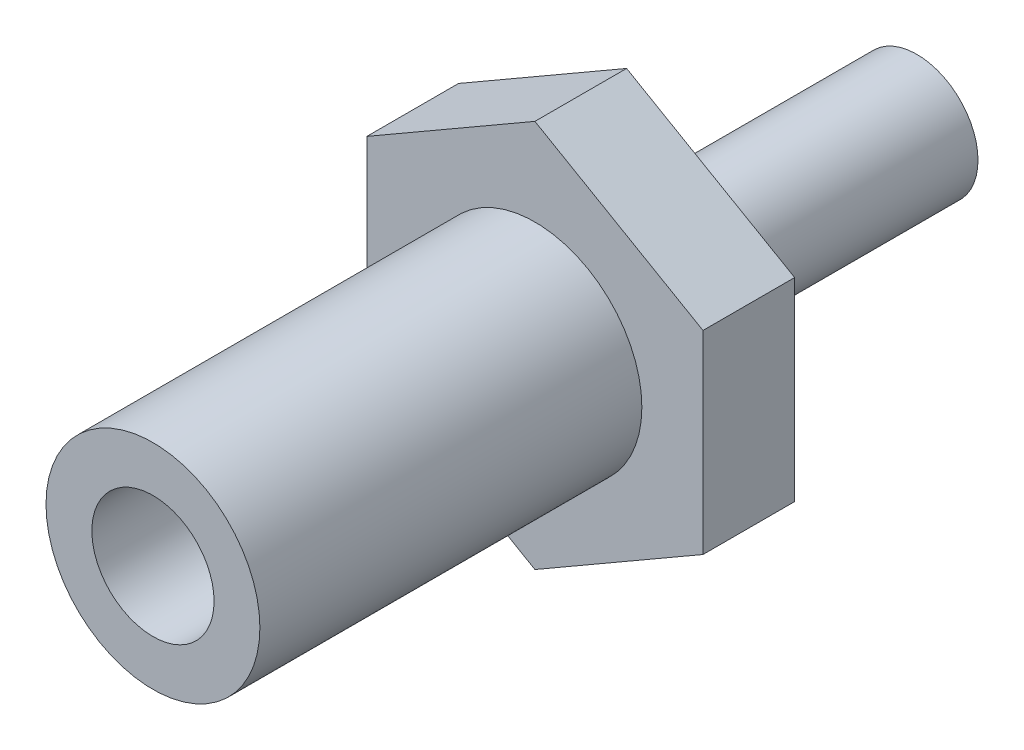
ISO-10303-21;
HEADER;
FILE_DESCRIPTION(('STEP AP214'),'2;1');
FILE_NAME('part.step','',(''),(''),'','','');
FILE_SCHEMA(('AUTOMOTIVE_DESIGN { 1 0 10303 214 1 1 1 1 }'));
ENDSEC;
DATA;
#1=APPLICATION_CONTEXT('core data for automotive mechanical design processes');
#2=APPLICATION_PROTOCOL_DEFINITION('international standard','automotive_design',2000,#1);
#3=PRODUCT_CONTEXT('',#1,'mechanical');
#4=PRODUCT('Part','Part','',(#3));
#5=PRODUCT_RELATED_PRODUCT_CATEGORY('part','',(#4));
#6=PRODUCT_DEFINITION_FORMATION('','',#4);
#7=PRODUCT_DEFINITION_CONTEXT('part definition',#1,'design');
#8=PRODUCT_DEFINITION('design','',#6,#7);
#9=PRODUCT_DEFINITION_SHAPE('','',#8);
#10=(LENGTH_UNIT() NAMED_UNIT(*) SI_UNIT(.MILLI.,.METRE.));
#11=(NAMED_UNIT(*) PLANE_ANGLE_UNIT() SI_UNIT($,.RADIAN.));
#12=(NAMED_UNIT(*) SI_UNIT($,.STERADIAN.) SOLID_ANGLE_UNIT());
#13=UNCERTAINTY_MEASURE_WITH_UNIT(LENGTH_MEASURE(1.E-05),#10,'distance_accuracy_value','');
#14=(GEOMETRIC_REPRESENTATION_CONTEXT(3) GLOBAL_UNCERTAINTY_ASSIGNED_CONTEXT((#13)) GLOBAL_UNIT_ASSIGNED_CONTEXT((#10,
#11,#12)) REPRESENTATION_CONTEXT('',''));
#15=CARTESIAN_POINT('',(0.,0.,0.));
#16=DIRECTION('',(0.,0.,1.));
#17=DIRECTION('',(1.,0.,0.));
#18=AXIS2_PLACEMENT_3D('',#15,#16,#17);
#19=CARTESIAN_POINT('',(15.,0.,6.));
#20=DIRECTION('',(0.,0.,-1.));
#21=DIRECTION('',(-1.,0.,0.));
#22=AXIS2_PLACEMENT_3D('',#19,#20,#21);
#23=PLANE('',#22);
#24=DIRECTION('',(-0.866025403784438,0.5,0.));
#25=VECTOR('',#24,1.);
#26=CARTESIAN_POINT('',(0.,-12.7017059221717,6.));
#27=LINE('',#26,#25);
#28=CARTESIAN_POINT('',(0.,-12.7017059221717,6.));
#29=VERTEX_POINT('',#28);
#30=CARTESIAN_POINT('',(-11.,-6.35085296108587,6.));
#31=VERTEX_POINT('',#30);
#32=EDGE_CURVE('E96',#29,#31,#27,.T.);
#33=ORIENTED_EDGE('',*,*,#32,.F.);
#34=DIRECTION('',(0.866025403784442,0.5,0.));
#35=VECTOR('',#34,1.);
#36=CARTESIAN_POINT('',(0.,-12.7017059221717,6.));
#37=LINE('',#36,#35);
#38=CARTESIAN_POINT('',(11.,-6.35085296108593,6.));
#39=VERTEX_POINT('',#38);
#40=EDGE_CURVE('E38',#29,#39,#37,.T.);
#41=ORIENTED_EDGE('',*,*,#40,.T.);
#42=DIRECTION('',(0.,-1.,0.));
#43=VECTOR('',#42,1.);
#44=CARTESIAN_POINT('',(11.,6.35085296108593,6.));
#45=LINE('',#44,#43);
#46=CARTESIAN_POINT('',(11.,6.35085296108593,6.));
#47=VERTEX_POINT('',#46);
#48=EDGE_CURVE('E75',#47,#39,#45,.T.);
#49=ORIENTED_EDGE('',*,*,#48,.F.);
#50=DIRECTION('',(0.866025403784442,-0.5,0.));
#51=VECTOR('',#50,1.);
#52=CARTESIAN_POINT('',(0.,12.7017059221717,6.));
#53=LINE('',#52,#51);
#54=CARTESIAN_POINT('',(0.,12.7017059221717,6.));
#55=VERTEX_POINT('',#54);
#56=EDGE_CURVE('E105',#55,#47,#53,.T.);
#57=ORIENTED_EDGE('',*,*,#56,.F.);
#58=DIRECTION('',(-0.866025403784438,-0.5,0.));
#59=VECTOR('',#58,1.);
#60=CARTESIAN_POINT('',(0.,12.7017059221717,6.));
#61=LINE('',#60,#59);
#62=CARTESIAN_POINT('',(-11.,6.35085296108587,6.));
#63=VERTEX_POINT('',#62);
#64=EDGE_CURVE('E102',#55,#63,#61,.T.);
#65=ORIENTED_EDGE('',*,*,#64,.T.);
#66=DIRECTION('',(0.,-1.,0.));
#67=VECTOR('',#66,1.);
#68=CARTESIAN_POINT('',(-11.,6.35085296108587,6.));
#69=LINE('',#68,#67);
#70=EDGE_CURVE('E99',#63,#31,#69,.T.);
#71=ORIENTED_EDGE('',*,*,#70,.T.);
#72=EDGE_LOOP('',(#33,#41,#49,#57,#65,#71));
#73=FACE_BOUND('',#72,.T.);
#74=CARTESIAN_POINT('',(0.,0.,6.));
#75=DIRECTION('',(0.,0.,1.));
#76=DIRECTION('',(1.,0.,0.));
#77=AXIS2_PLACEMENT_3D('',#74,#75,#76);
#78=CIRCLE('',#77,7.);
#79=CARTESIAN_POINT('',(7.,0.,6.));
#80=VERTEX_POINT('',#79);
#81=EDGE_CURVE('E9',#80,#80,#78,.T.);
#82=ORIENTED_EDGE('',*,*,#81,.F.);
#83=EDGE_LOOP('',(#82));
#84=FACE_BOUND('',#83,.T.);
#85=ADVANCED_FACE('F15',(#73,#84),#23,.F.);
#86=CARTESIAN_POINT('',(0.,0.,50.));
#87=DIRECTION('',(0.,0.,1.));
#88=DIRECTION('',(1.,0.,0.));
#89=AXIS2_PLACEMENT_3D('',#86,#87,#88);
#90=CYLINDRICAL_SURFACE('',#89,7.);
#91=CARTESIAN_POINT('',(0.,0.,31.));
#92=DIRECTION('',(0.,0.,1.));
#93=DIRECTION('',(1.,0.,0.));
#94=AXIS2_PLACEMENT_3D('',#91,#92,#93);
#95=CIRCLE('',#94,7.);
#96=CARTESIAN_POINT('',(7.,0.,31.));
#97=VERTEX_POINT('',#96);
#98=EDGE_CURVE('E23',#97,#97,#95,.T.);
#99=ORIENTED_EDGE('',*,*,#98,.F.);
#100=EDGE_LOOP('',(#99));
#101=FACE_BOUND('',#100,.T.);
#102=ORIENTED_EDGE('',*,*,#81,.T.);
#103=EDGE_LOOP('',(#102));
#104=FACE_BOUND('',#103,.T.);
#105=ADVANCED_FACE('F134',(#101,#104),#90,.T.);
#106=CARTESIAN_POINT('',(7.,0.,31.));
#107=DIRECTION('',(0.,0.,-1.));
#108=DIRECTION('',(-1.,0.,0.));
#109=AXIS2_PLACEMENT_3D('',#106,#107,#108);
#110=PLANE('',#109);
#111=CARTESIAN_POINT('',(0.,0.,31.));
#112=DIRECTION('',(0.,0.,1.));
#113=DIRECTION('',(1.,0.,0.));
#114=AXIS2_PLACEMENT_3D('',#111,#112,#113);
#115=CIRCLE('',#114,4.);
#116=CARTESIAN_POINT('',(4.,0.,31.));
#117=VERTEX_POINT('',#116);
#118=EDGE_CURVE('E127',#117,#117,#115,.T.);
#119=ORIENTED_EDGE('',*,*,#118,.F.);
#120=EDGE_LOOP('',(#119));
#121=FACE_BOUND('',#120,.T.);
#122=ORIENTED_EDGE('',*,*,#98,.T.);
#123=EDGE_LOOP('',(#122));
#124=FACE_BOUND('',#123,.T.);
#125=ADVANCED_FACE('F132',(#121,#124),#110,.F.);
#126=CARTESIAN_POINT('',(0.,0.,50.));
#127=DIRECTION('',(0.,0.,1.));
#128=DIRECTION('',(1.,0.,0.));
#129=AXIS2_PLACEMENT_3D('',#126,#127,#128);
#130=CYLINDRICAL_SURFACE('',#129,4.);
#131=CARTESIAN_POINT('',(0.,0.,7.));
#132=DIRECTION('',(0.,0.,1.));
#133=DIRECTION('',(1.,0.,0.));
#134=AXIS2_PLACEMENT_3D('',#131,#132,#133);
#135=CIRCLE('',#134,4.);
#136=CARTESIAN_POINT('',(4.,0.,7.));
#137=VERTEX_POINT('',#136);
#138=EDGE_CURVE('E124',#137,#137,#135,.T.);
#139=ORIENTED_EDGE('',*,*,#138,.F.);
#140=EDGE_LOOP('',(#139));
#141=FACE_BOUND('',#140,.T.);
#142=ORIENTED_EDGE('',*,*,#118,.T.);
#143=EDGE_LOOP('',(#142));
#144=FACE_BOUND('',#143,.T.);
#145=ADVANCED_FACE('F150',(#141,#144),#130,.F.);
#146=CARTESIAN_POINT('',(4.,0.,7.));
#147=DIRECTION('',(0.,0.,-1.));
#148=DIRECTION('',(-1.,0.,0.));
#149=AXIS2_PLACEMENT_3D('',#146,#147,#148);
#150=PLANE('',#149);
#151=ORIENTED_EDGE('',*,*,#138,.T.);
#152=EDGE_LOOP('',(#151));
#153=FACE_BOUND('',#152,.T.);
#154=ADVANCED_FACE('F154',(#153),#150,.F.);
#155=CARTESIAN_POINT('',(0.,-12.7017059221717,6.));
#156=DIRECTION('',(-0.5,0.866025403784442,0.));
#157=DIRECTION('',(-0.866025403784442,-0.5,0.));
#158=AXIS2_PLACEMENT_3D('',#155,#156,#157);
#159=PLANE('',#158);
#160=DIRECTION('',(0.,0.,-1.));
#161=VECTOR('',#160,1.);
#162=CARTESIAN_POINT('',(11.,-6.35085296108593,6.));
#163=LINE('',#162,#161);
#164=CARTESIAN_POINT('',(11.,-6.35085296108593,0.));
#165=VERTEX_POINT('',#164);
#166=EDGE_CURVE('E68',#39,#165,#163,.T.);
#167=ORIENTED_EDGE('',*,*,#166,.F.);
#168=ORIENTED_EDGE('',*,*,#40,.F.);
#169=DIRECTION('',(0.,0.,-1.));
#170=VECTOR('',#169,1.);
#171=CARTESIAN_POINT('',(0.,-12.7017059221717,6.));
#172=LINE('',#171,#170);
#173=CARTESIAN_POINT('',(0.,-12.7017059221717,0.));
#174=VERTEX_POINT('',#173);
#175=EDGE_CURVE('E82',#29,#174,#172,.T.);
#176=ORIENTED_EDGE('',*,*,#175,.T.);
#177=DIRECTION('',(0.866025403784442,0.5,0.));
#178=VECTOR('',#177,1.);
#179=CARTESIAN_POINT('',(0.,-12.7017059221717,0.));
#180=LINE('',#179,#178);
#181=EDGE_CURVE('E80',#174,#165,#180,.T.);
#182=ORIENTED_EDGE('',*,*,#181,.T.);
#183=EDGE_LOOP('',(#167,#168,#176,#182));
#184=FACE_BOUND('',#183,.T.);
#185=ADVANCED_FACE('F81',(#184),#159,.F.);
#186=CARTESIAN_POINT('',(11.,6.35085296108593,6.));
#187=DIRECTION('',(1.,0.,0.));
#188=DIRECTION('',(0.,0.,-1.));
#189=AXIS2_PLACEMENT_3D('',#186,#187,#188);
#190=PLANE('',#189);
#191=DIRECTION('',(0.,0.,-1.));
#192=VECTOR('',#191,1.);
#193=CARTESIAN_POINT('',(11.,6.35085296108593,6.));
#194=LINE('',#193,#192);
#195=CARTESIAN_POINT('',(11.,6.35085296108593,0.));
#196=VERTEX_POINT('',#195);
#197=EDGE_CURVE('E77',#47,#196,#194,.T.);
#198=ORIENTED_EDGE('',*,*,#197,.F.);
#199=ORIENTED_EDGE('',*,*,#48,.T.);
#200=ORIENTED_EDGE('',*,*,#166,.T.);
#201=DIRECTION('',(0.,-1.,0.));
#202=VECTOR('',#201,1.);
#203=CARTESIAN_POINT('',(11.,6.35085296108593,0.));
#204=LINE('',#203,#202);
#205=EDGE_CURVE('E72',#196,#165,#204,.T.);
#206=ORIENTED_EDGE('',*,*,#205,.F.);
#207=EDGE_LOOP('',(#198,#199,#200,#206));
#208=FACE_BOUND('',#207,.T.);
#209=ADVANCED_FACE('F70',(#208),#190,.T.);
#210=CARTESIAN_POINT('',(0.,12.7017059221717,6.));
#211=DIRECTION('',(0.5,0.866025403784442,0.));
#212=DIRECTION('',(-0.866025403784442,0.5,0.));
#213=AXIS2_PLACEMENT_3D('',#210,#211,#212);
#214=PLANE('',#213);
#215=DIRECTION('',(0.,0.,-1.));
#216=VECTOR('',#215,1.);
#217=CARTESIAN_POINT('',(0.,12.7017059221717,6.));
#218=LINE('',#217,#216);
#219=CARTESIAN_POINT('',(0.,12.7017059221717,0.));
#220=VERTEX_POINT('',#219);
#221=EDGE_CURVE('E116',#55,#220,#218,.T.);
#222=ORIENTED_EDGE('',*,*,#221,.F.);
#223=ORIENTED_EDGE('',*,*,#56,.T.);
#224=ORIENTED_EDGE('',*,*,#197,.T.);
#225=DIRECTION('',(0.866025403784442,-0.5,0.));
#226=VECTOR('',#225,1.);
#227=CARTESIAN_POINT('',(0.,12.7017059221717,0.));
#228=LINE('',#227,#226);
#229=EDGE_CURVE('E90',#220,#196,#228,.T.);
#230=ORIENTED_EDGE('',*,*,#229,.F.);
#231=EDGE_LOOP('',(#222,#223,#224,#230));
#232=FACE_BOUND('',#231,.T.);
#233=ADVANCED_FACE('F170',(#232),#214,.T.);
#234=CARTESIAN_POINT('',(0.,12.7017059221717,6.));
#235=DIRECTION('',(0.5,-0.866025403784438,0.));
#236=DIRECTION('',(0.866025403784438,0.5,0.));
#237=AXIS2_PLACEMENT_3D('',#234,#235,#236);
#238=PLANE('',#237);
#239=DIRECTION('',(0.,0.,-1.));
#240=VECTOR('',#239,1.);
#241=CARTESIAN_POINT('',(-11.,6.35085296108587,6.));
#242=LINE('',#241,#240);
#243=CARTESIAN_POINT('',(-11.,6.35085296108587,0.));
#244=VERTEX_POINT('',#243);
#245=EDGE_CURVE('E114',#63,#244,#242,.T.);
#246=ORIENTED_EDGE('',*,*,#245,.F.);
#247=ORIENTED_EDGE('',*,*,#64,.F.);
#248=ORIENTED_EDGE('',*,*,#221,.T.);
#249=DIRECTION('',(-0.866025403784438,-0.5,0.));
#250=VECTOR('',#249,1.);
#251=CARTESIAN_POINT('',(0.,12.7017059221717,0.));
#252=LINE('',#251,#250);
#253=EDGE_CURVE('E92',#220,#244,#252,.T.);
#254=ORIENTED_EDGE('',*,*,#253,.T.);
#255=EDGE_LOOP('',(#246,#247,#248,#254));
#256=FACE_BOUND('',#255,.T.);
#257=ADVANCED_FACE('F173',(#256),#238,.F.);
#258=CARTESIAN_POINT('',(-11.,6.35085296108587,6.));
#259=DIRECTION('',(1.,0.,0.));
#260=DIRECTION('',(0.,0.,-1.));
#261=AXIS2_PLACEMENT_3D('',#258,#259,#260);
#262=PLANE('',#261);
#263=DIRECTION('',(0.,0.,-1.));
#264=VECTOR('',#263,1.);
#265=CARTESIAN_POINT('',(-11.,-6.35085296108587,6.));
#266=LINE('',#265,#264);
#267=CARTESIAN_POINT('',(-11.,-6.35085296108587,0.));
#268=VERTEX_POINT('',#267);
#269=EDGE_CURVE('E112',#31,#268,#266,.T.);
#270=ORIENTED_EDGE('',*,*,#269,.F.);
#271=ORIENTED_EDGE('',*,*,#70,.F.);
#272=ORIENTED_EDGE('',*,*,#245,.T.);
#273=DIRECTION('',(0.,-1.,0.));
#274=VECTOR('',#273,1.);
#275=CARTESIAN_POINT('',(-11.,6.35085296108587,0.));
#276=LINE('',#275,#274);
#277=EDGE_CURVE('E30',#244,#268,#276,.T.);
#278=ORIENTED_EDGE('',*,*,#277,.T.);
#279=EDGE_LOOP('',(#270,#271,#272,#278));
#280=FACE_BOUND('',#279,.T.);
#281=ADVANCED_FACE('F177',(#280),#262,.F.);
#282=CARTESIAN_POINT('',(0.,-12.7017059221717,6.));
#283=DIRECTION('',(-0.5,-0.866025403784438,0.));
#284=DIRECTION('',(0.866025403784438,-0.5,0.));
#285=AXIS2_PLACEMENT_3D('',#282,#283,#284);
#286=PLANE('',#285);
#287=ORIENTED_EDGE('',*,*,#32,.T.);
#288=ORIENTED_EDGE('',*,*,#269,.T.);
#289=DIRECTION('',(-0.866025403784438,0.5,0.));
#290=VECTOR('',#289,1.);
#291=CARTESIAN_POINT('',(0.,-12.7017059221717,0.));
#292=LINE('',#291,#290);
#293=EDGE_CURVE('E110',#174,#268,#292,.T.);
#294=ORIENTED_EDGE('',*,*,#293,.F.);
#295=ORIENTED_EDGE('',*,*,#175,.F.);
#296=EDGE_LOOP('',(#287,#288,#294,#295));
#297=FACE_BOUND('',#296,.T.);
#298=ADVANCED_FACE('F163',(#297),#286,.T.);
#299=CARTESIAN_POINT('',(0.,0.,-19.));
#300=DIRECTION('',(0.,0.,1.));
#301=DIRECTION('',(1.,0.,0.));
#302=AXIS2_PLACEMENT_3D('',#299,#300,#301);
#303=PLANE('',#302);
#304=CARTESIAN_POINT('',(0.,0.,-19.));
#305=DIRECTION('',(0.,0.,1.));
#306=DIRECTION('',(1.,0.,0.));
#307=AXIS2_PLACEMENT_3D('',#304,#305,#306);
#308=CIRCLE('',#307,4.);
#309=CARTESIAN_POINT('',(4.,0.,-19.));
#310=VERTEX_POINT('',#309);
#311=EDGE_CURVE('E121',#310,#310,#308,.T.);
#312=ORIENTED_EDGE('',*,*,#311,.F.);
#313=EDGE_LOOP('',(#312));
#314=FACE_BOUND('',#313,.T.);
#315=ADVANCED_FACE('F159',(#314),#303,.F.);
#316=CARTESIAN_POINT('',(0.,0.,50.));
#317=DIRECTION('',(0.,0.,1.));
#318=DIRECTION('',(1.,0.,0.));
#319=AXIS2_PLACEMENT_3D('',#316,#317,#318);
#320=CYLINDRICAL_SURFACE('',#319,4.);
#321=CARTESIAN_POINT('',(0.,0.,0.));
#322=DIRECTION('',(0.,0.,1.));
#323=DIRECTION('',(1.,0.,0.));
#324=AXIS2_PLACEMENT_3D('',#321,#322,#323);
#325=CIRCLE('',#324,4.);
#326=CARTESIAN_POINT('',(4.,0.,0.));
#327=VERTEX_POINT('',#326);
#328=EDGE_CURVE('E76',#327,#327,#325,.T.);
#329=ORIENTED_EDGE('',*,*,#328,.F.);
#330=EDGE_LOOP('',(#329));
#331=FACE_BOUND('',#330,.T.);
#332=ORIENTED_EDGE('',*,*,#311,.T.);
#333=EDGE_LOOP('',(#332));
#334=FACE_BOUND('',#333,.T.);
#335=ADVANCED_FACE('F162',(#331,#334),#320,.T.);
#336=CARTESIAN_POINT('',(4.,0.,0.));
#337=DIRECTION('',(0.,0.,1.));
#338=DIRECTION('',(1.,0.,0.));
#339=AXIS2_PLACEMENT_3D('',#336,#337,#338);
#340=PLANE('',#339);
#341=ORIENTED_EDGE('',*,*,#205,.T.);
#342=ORIENTED_EDGE('',*,*,#181,.F.);
#343=ORIENTED_EDGE('',*,*,#293,.T.);
#344=ORIENTED_EDGE('',*,*,#277,.F.);
#345=ORIENTED_EDGE('',*,*,#253,.F.);
#346=ORIENTED_EDGE('',*,*,#229,.T.);
#347=EDGE_LOOP('',(#341,#342,#343,#344,#345,#346));
#348=FACE_BOUND('',#347,.T.);
#349=ORIENTED_EDGE('',*,*,#328,.T.);
#350=EDGE_LOOP('',(#349));
#351=FACE_BOUND('',#350,.T.);
#352=ADVANCED_FACE('F17',(#348,#351),#340,.F.);
#353=CLOSED_SHELL('',(#85,#105,#125,#145,#154,#185,#209,#233,#257,#281,#298,#315,#335,#352));
#354=MANIFOLD_SOLID_BREP('B1',#353);
#355=ADVANCED_BREP_SHAPE_REPRESENTATION('',(#18,#354),#14);
#356=SHAPE_DEFINITION_REPRESENTATION(#9,#355);
ENDSEC;
END-ISO-10303-21;
